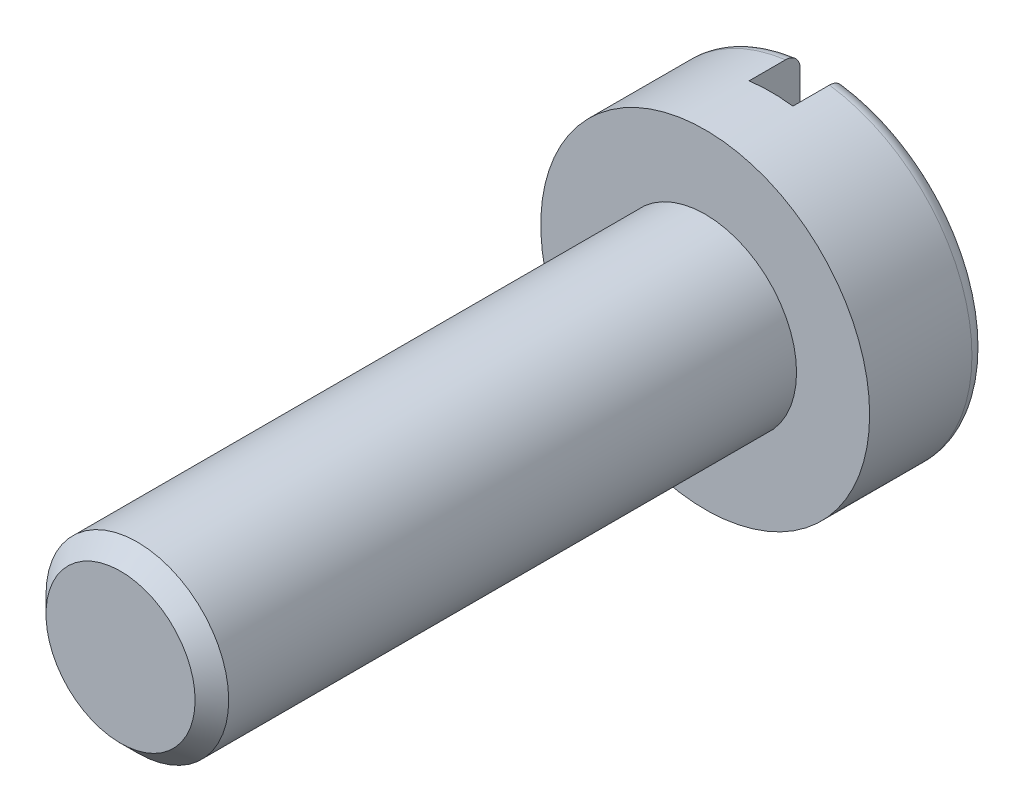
ISO-10303-21;
HEADER;
FILE_DESCRIPTION(('STEP AP214'),'2;1');
FILE_NAME('part.step','',(''),(''),'','','');
FILE_SCHEMA(('AUTOMOTIVE_DESIGN { 1 0 10303 214 1 1 1 1 }'));
ENDSEC;
DATA;
#1=APPLICATION_CONTEXT('core data for automotive mechanical design processes');
#2=APPLICATION_PROTOCOL_DEFINITION('international standard','automotive_design',2000,#1);
#3=PRODUCT_CONTEXT('',#1,'mechanical');
#4=PRODUCT('Part','Part','',(#3));
#5=PRODUCT_RELATED_PRODUCT_CATEGORY('part','',(#4));
#6=PRODUCT_DEFINITION_FORMATION('','',#4);
#7=PRODUCT_DEFINITION_CONTEXT('part definition',#1,'design');
#8=PRODUCT_DEFINITION('design','',#6,#7);
#9=PRODUCT_DEFINITION_SHAPE('','',#8);
#10=(LENGTH_UNIT() NAMED_UNIT(*) SI_UNIT(.MILLI.,.METRE.));
#11=(NAMED_UNIT(*) PLANE_ANGLE_UNIT() SI_UNIT($,.RADIAN.));
#12=(NAMED_UNIT(*) SI_UNIT($,.STERADIAN.) SOLID_ANGLE_UNIT());
#13=UNCERTAINTY_MEASURE_WITH_UNIT(LENGTH_MEASURE(1.E-05),#10,'distance_accuracy_value','');
#14=(GEOMETRIC_REPRESENTATION_CONTEXT(3) GLOBAL_UNCERTAINTY_ASSIGNED_CONTEXT((#13)) GLOBAL_UNIT_ASSIGNED_CONTEXT((#10,
#11,#12)) REPRESENTATION_CONTEXT('',''));
#15=CARTESIAN_POINT('',(0.,0.,0.));
#16=DIRECTION('',(0.,0.,1.));
#17=DIRECTION('',(1.,0.,0.));
#18=AXIS2_PLACEMENT_3D('',#15,#16,#17);
#19=CARTESIAN_POINT('',(0.,0.,-1.6));
#20=DIRECTION('',(0.,0.,1.));
#21=DIRECTION('',(1.,0.,0.));
#22=AXIS2_PLACEMENT_3D('',#19,#20,#21);
#23=PLANE('',#22);
#24=CARTESIAN_POINT('',(0.,0.,-1.6));
#25=DIRECTION('',(0.,0.,1.));
#26=DIRECTION('',(1.,0.,0.));
#27=AXIS2_PLACEMENT_3D('',#24,#25,#26);
#28=CIRCLE('',#27,2.05);
#29=CARTESIAN_POINT('',(0.3,2.02792997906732,-1.6));
#30=VERTEX_POINT('',#29);
#31=CARTESIAN_POINT('',(0.299999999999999,-2.02792997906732,-1.6));
#32=VERTEX_POINT('',#31);
#33=EDGE_CURVE('E92',#30,#32,#28,.F.);
#34=ORIENTED_EDGE('',*,*,#33,.T.);
#35=DIRECTION('',(0.,-1.,0.));
#36=VECTOR('',#35,1.);
#37=CARTESIAN_POINT('',(0.3,2.25,-1.6));
#38=LINE('',#37,#36);
#39=EDGE_CURVE('E80',#30,#32,#38,.T.);
#40=ORIENTED_EDGE('',*,*,#39,.F.);
#41=EDGE_LOOP('',(#34,#40));
#42=FACE_BOUND('',#41,.T.);
#43=ADVANCED_FACE('F26',(#42),#23,.F.);
#44=CARTESIAN_POINT('',(0.,0.,-1.4));
#45=DIRECTION('',(0.,0.,1.));
#46=DIRECTION('',(1.,0.,0.));
#47=AXIS2_PLACEMENT_3D('',#44,#45,#46);
#48=TOROIDAL_SURFACE('',#47,2.05,0.2);
#49=CARTESIAN_POINT('',(0.300000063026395,-2.1709840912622,-1.54122853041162));
#50=CARTESIAN_POINT('',(0.300000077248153,-2.17893682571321,-1.53332849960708));
#51=CARTESIAN_POINT('',(0.300000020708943,-2.18623203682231,-1.52475564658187));
#52=CARTESIAN_POINT('',(0.299999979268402,-2.19928820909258,-1.50650164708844));
#53=CARTESIAN_POINT('',(0.299999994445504,-2.20504748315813,-1.49681929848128));
#54=CARTESIAN_POINT('',(0.300000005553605,-2.2148541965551,-1.47662386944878));
#55=CARTESIAN_POINT('',(0.300000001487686,-2.21890190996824,-1.46611092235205));
#56=CARTESIAN_POINT('',(0.299999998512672,-2.22516408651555,-1.44455521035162));
#57=CARTESIAN_POINT('',(0.299999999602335,-2.22737899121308,-1.43351257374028));
#58=CARTESIAN_POINT('',(0.300000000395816,-2.22990492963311,-1.41126370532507));
#59=CARTESIAN_POINT('',(0.300000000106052,-2.2302247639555,-1.40005847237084));
#60=CARTESIAN_POINT('',(0.299999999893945,-2.22897446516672,-1.37775374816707));
#61=CARTESIAN_POINT('',(0.299999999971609,-2.22740430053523,-1.36665425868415));
#62=CARTESIAN_POINT('',(0.300000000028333,-2.22242592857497,-1.3448993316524));
#63=CARTESIAN_POINT('',(0.300000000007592,-2.2190214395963,-1.33424304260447));
#64=CARTESIAN_POINT('',(0.299999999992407,-2.21047750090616,-1.31365059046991));
#65=CARTESIAN_POINT('',(0.299999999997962,-2.20533803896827,-1.30371443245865));
#66=CARTESIAN_POINT('',(0.300000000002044,-2.19345463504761,-1.28480701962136));
#67=CARTESIAN_POINT('',(0.300000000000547,-2.18670540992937,-1.27583908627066));
#68=CARTESIAN_POINT('',(0.299999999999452,-2.17180762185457,-1.25915291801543));
#69=CARTESIAN_POINT('',(0.299999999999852,-2.16365901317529,-1.25143472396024));
#70=CARTESIAN_POINT('',(0.300000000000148,-2.146128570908,-1.23740309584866));
#71=CARTESIAN_POINT('',(0.300000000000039,-2.13673782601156,-1.23110079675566));
#72=CARTESIAN_POINT('',(0.29999999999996,-2.11703939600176,-1.2201451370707));
#73=CARTESIAN_POINT('',(0.299999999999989,-2.10673166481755,-1.21549185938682));
#74=CARTESIAN_POINT('',(0.30000000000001,-2.08538820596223,-1.20792055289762));
#75=CARTESIAN_POINT('',(0.300000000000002,-2.07434654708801,-1.2050192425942));
#76=CARTESIAN_POINT('',(0.299999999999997,-2.05193422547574,-1.2010958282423));
#77=CARTESIAN_POINT('',(0.299999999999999,-2.04056354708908,-1.20007381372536));
#78=CARTESIAN_POINT('',(0.3,-2.01772278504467,-1.19993337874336));
#79=CARTESIAN_POINT('',(0.3,-2.0062526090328,-1.20082964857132));
#80=CARTESIAN_POINT('',(0.299999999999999,-1.98362399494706,-1.20453007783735));
#81=CARTESIAN_POINT('',(0.299999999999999,-1.9724655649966,-1.20733428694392));
#82=CARTESIAN_POINT('',(0.3,-1.95075092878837,-1.21478350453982));
#83=CARTESIAN_POINT('',(0.3,-1.94019621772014,-1.21943287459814));
#84=CARTESIAN_POINT('',(0.3,-1.92002233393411,-1.23044608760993));
#85=CARTESIAN_POINT('',(0.3,-1.91040314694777,-1.23680990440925));
#86=CARTESIAN_POINT('',(0.3,-1.89242824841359,-1.25104144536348));
#87=CARTESIAN_POINT('',(0.3,-1.88406646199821,-1.25890149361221));
#88=CARTESIAN_POINT('',(0.3,-1.8687991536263,-1.27592777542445));
#89=CARTESIAN_POINT('',(0.3,-1.86189354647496,-1.28509393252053));
#90=CARTESIAN_POINT('',(0.3,-1.84981768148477,-1.30436465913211));
#91=CARTESIAN_POINT('',(0.3,-1.84462908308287,-1.31445773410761));
#92=CARTESIAN_POINT('',(0.3,-1.83604355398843,-1.33537915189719));
#93=CARTESIAN_POINT('',(0.3,-1.83264649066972,-1.3462074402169));
#94=CARTESIAN_POINT('',(0.299999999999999,-1.82778000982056,-1.36815312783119));
#95=CARTESIAN_POINT('',(0.299999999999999,-1.82628809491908,-1.37926554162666));
#96=CARTESIAN_POINT('',(0.3,-1.82520407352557,-1.40158243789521));
#97=CARTESIAN_POINT('',(0.3,-1.8256118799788,-1.41278691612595));
#98=CARTESIAN_POINT('',(0.299999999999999,-1.82830587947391,-1.43489632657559));
#99=CARTESIAN_POINT('',(0.299999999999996,-1.83058034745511,-1.44580269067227));
#100=CARTESIAN_POINT('',(0.300000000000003,-1.83692271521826,-1.46708049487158));
#101=CARTESIAN_POINT('',(0.300000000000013,-1.84099062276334,-1.4774519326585));
#102=CARTESIAN_POINT('',(0.299999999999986,-1.85081202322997,-1.49740186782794));
#103=CARTESIAN_POINT('',(0.299999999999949,-1.85657056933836,-1.50697787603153));
#104=CARTESIAN_POINT('',(0.30000000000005,-1.86959793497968,-1.52504031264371));
#105=CARTESIAN_POINT('',(0.300000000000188,-1.87686683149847,-1.53352668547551));
#106=CARTESIAN_POINT('',(0.299999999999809,-1.8927880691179,-1.54926473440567));
#107=CARTESIAN_POINT('',(0.299999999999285,-1.90145403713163,-1.55650262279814));
#108=CARTESIAN_POINT('',(0.300000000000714,-1.91986584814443,-1.56944163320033));
#109=CARTESIAN_POINT('',(0.300000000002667,-1.92961176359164,-1.57514265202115));
#110=CARTESIAN_POINT('',(0.2999999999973,-1.95003368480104,-1.58491703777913));
#111=CARTESIAN_POINT('',(0.299999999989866,-1.96071951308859,-1.58896988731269));
#112=CARTESIAN_POINT('',(0.300000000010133,-1.98261648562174,-1.59523980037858));
#113=CARTESIAN_POINT('',(0.300000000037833,-1.99382763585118,-1.59745684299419));
#114=CARTESIAN_POINT('',(0.299999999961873,-2.01655037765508,-1.60000534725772));
#115=CARTESIAN_POINT('',(0.299999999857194,-2.02806362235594,-1.60032209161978));
#116=CARTESIAN_POINT('',(0.300000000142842,-2.05098342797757,-1.59901962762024));
#117=CARTESIAN_POINT('',(0.300000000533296,-2.06238996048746,-1.59739991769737));
#118=CARTESIAN_POINT('',(0.299999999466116,-2.08477996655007,-1.59226300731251));
#119=CARTESIAN_POINT('',(0.299999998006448,-2.09576296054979,-1.58874371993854));
#120=CARTESIAN_POINT('',(0.300000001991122,-2.11696703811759,-1.57990187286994));
#121=CARTESIAN_POINT('',(0.300000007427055,-2.12718903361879,-1.57458151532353));
#122=CARTESIAN_POINT('',(0.29999999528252,-2.14303507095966,-1.56453623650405));
#123=CARTESIAN_POINT('',(0.299999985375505,-2.14897604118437,-1.56030221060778));
#124=CARTESIAN_POINT('',(0.300000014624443,-2.16036534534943,-1.5512164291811));
#125=CARTESIAN_POINT('',(0.300000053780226,-2.16581368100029,-1.54636467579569));
#126=CARTESIAN_POINT('',(0.300000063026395,-2.1709840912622,-1.54122853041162));
#127=B_SPLINE_CURVE_WITH_KNOTS('',3,(#49,#50,#51,#52,#53,#54,#55,#56,#57,#58,#59,#60,#61,#62,
#63,#64,#65,#66,#67,#68,#69,#70,#71,#72,#73,#74,#75,#76,#77,#78,#79,#80,#81,#82,#83,#84,#85,#86,
#87,#88,#89,#90,#91,#92,#93,#94,#95,#96,#97,#98,#99,#100,#101,#102,#103,#104,#105,#106,#107,
#108,#109,#110,#111,#112,#113,#114,#115,#116,#117,#118,#119,#120,#121,#122,#123,#124,#125,#126),
.UNSPECIFIED.,.T.,.F.,(4,2,2,2,2,2,2,2,2,2,2,2,2,2,2,2,2,2,2,2,2,2,2,2,2,2,2,2,2,2,2,2,2,2,2,2,
2,2,4),(0.,0.033602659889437,0.0672420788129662,0.100876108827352,0.134502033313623,
0.167971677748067,0.201441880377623,0.234844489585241,0.268247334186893,0.301761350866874,
0.335276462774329,0.369046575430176,0.402818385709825,0.436907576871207,0.470998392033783,
0.505351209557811,0.539704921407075,0.574140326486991,0.608575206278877,0.642837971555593,
0.67709873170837,0.710980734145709,0.744860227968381,0.778335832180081,0.811809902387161,
0.84507530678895,0.878340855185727,0.911706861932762,0.945074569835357,0.978789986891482,
1.01250766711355,1.0466331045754,1.08075893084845,1.11514871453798,1.14954740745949,
1.183983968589,1.21837857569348,1.24022516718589,1.26207168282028),.UNSPECIFIED.);
#128=CARTESIAN_POINT('',(0.299999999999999,-2.22991031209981,-1.40000000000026));
#129=VERTEX_POINT('',#128);
#130=EDGE_CURVE('E49',#32,#129,#127,.T.);
#131=ORIENTED_EDGE('',*,*,#130,.F.);
#132=ORIENTED_EDGE('',*,*,#33,.F.);
#133=CARTESIAN_POINT('',(0.3,1.82891649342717,-1.43649504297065));
#134=CARTESIAN_POINT('',(0.3,1.82686542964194,-1.4255865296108));
#135=CARTESIAN_POINT('',(0.3,1.82573407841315,-1.4144970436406));
#136=CARTESIAN_POINT('',(0.3,1.82535130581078,-1.3922769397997));
#137=CARTESIAN_POINT('',(0.3,1.82610203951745,-1.38114628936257));
#138=CARTESIAN_POINT('',(0.3,1.82946219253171,-1.35917492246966));
#139=CARTESIAN_POINT('',(0.3,1.8320705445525,-1.34833404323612));
#140=CARTESIAN_POINT('',(0.3,1.83906432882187,-1.32724495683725));
#141=CARTESIAN_POINT('',(0.3,1.84344937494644,-1.31699662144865));
#142=CARTESIAN_POINT('',(0.3,1.8538808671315,-1.29734280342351));
#143=CARTESIAN_POINT('',(0.3,1.85993247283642,-1.28794006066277));
#144=CARTESIAN_POINT('',(0.3,1.87351267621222,-1.27026956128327));
#145=CARTESIAN_POINT('',(0.3,1.88104139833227,-1.26200190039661));
#146=CARTESIAN_POINT('',(0.3,1.89744800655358,-1.24673992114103));
#147=CARTESIAN_POINT('',(0.3,1.90633961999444,-1.23976036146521));
#148=CARTESIAN_POINT('',(0.3,1.92515691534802,-1.22737212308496));
#149=CARTESIAN_POINT('',(0.3,1.93508266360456,-1.22196354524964));
#150=CARTESIAN_POINT('',(0.3,1.95581376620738,-1.21280503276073));
#151=CARTESIAN_POINT('',(0.3,1.96662818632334,-1.20907561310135));
#152=CARTESIAN_POINT('',(0.3,1.98872728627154,-1.20347045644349));
#153=CARTESIAN_POINT('',(0.3,2.00001198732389,-1.20159480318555));
#154=CARTESIAN_POINT('',(0.3,2.0228189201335,-1.19974163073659));
#155=CARTESIAN_POINT('',(0.3,2.03434228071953,-1.19977796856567));
#156=CARTESIAN_POINT('',(0.3,2.05721963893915,-1.20178454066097));
#157=CARTESIAN_POINT('',(0.3,2.06857363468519,-1.20375479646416));
#158=CARTESIAN_POINT('',(0.3,2.09078782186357,-1.20957833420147));
#159=CARTESIAN_POINT('',(0.3,2.10164803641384,-1.21343152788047));
#160=CARTESIAN_POINT('',(0.3,2.12256133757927,-1.2229179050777));
#161=CARTESIAN_POINT('',(0.3,2.13261444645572,-1.22855103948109));
#162=CARTESIAN_POINT('',(0.3,2.15155823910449,-1.24140147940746));
#163=CARTESIAN_POINT('',(0.3,2.16045589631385,-1.24860850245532));
#164=CARTESIAN_POINT('',(0.3,2.17690064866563,-1.26442685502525));
#165=CARTESIAN_POINT('',(0.3,2.18444781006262,-1.27303811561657));
#166=CARTESIAN_POINT('',(0.3,2.19790223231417,-1.29133439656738));
#167=CARTESIAN_POINT('',(0.3,2.20382413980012,-1.30100864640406));
#168=CARTESIAN_POINT('',(0.3,2.21394351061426,-1.32122056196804));
#169=CARTESIAN_POINT('',(0.3,2.21814106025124,-1.33175818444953));
#170=CARTESIAN_POINT('',(0.3,2.22465708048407,-1.35330117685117));
#171=CARTESIAN_POINT('',(0.3,2.22699122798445,-1.36430180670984));
#172=CARTESIAN_POINT('',(0.3,2.22976979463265,-1.38653909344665));
#173=CARTESIAN_POINT('',(0.3,2.23021427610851,-1.39777574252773));
#174=CARTESIAN_POINT('',(0.3,2.22920268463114,-1.42010972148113));
#175=CARTESIAN_POINT('',(0.3,2.22775557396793,-1.43120745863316));
#176=CARTESIAN_POINT('',(0.3,2.22301952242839,-1.45300249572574));
#177=CARTESIAN_POINT('',(0.3,2.21973059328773,-1.46369979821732));
#178=CARTESIAN_POINT('',(0.3,2.21140609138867,-1.48439782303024));
#179=CARTESIAN_POINT('',(0.3,2.20636961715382,-1.49439818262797));
#180=CARTESIAN_POINT('',(0.3,2.19469807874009,-1.51341762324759));
#181=CARTESIAN_POINT('',(0.3,2.18806297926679,-1.52243668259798));
#182=CARTESIAN_POINT('',(0.3,2.17334518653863,-1.53929284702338));
#183=CARTESIAN_POINT('',(0.3,2.16525465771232,-1.5471231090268));
#184=CARTESIAN_POINT('',(0.3,2.14788391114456,-1.56132851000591));
#185=CARTESIAN_POINT('',(0.3,2.13860364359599,-1.5677035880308));
#186=CARTESIAN_POINT('',(0.3,2.11902962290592,-1.57887821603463));
#187=CARTESIAN_POINT('',(0.3,2.10872764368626,-1.58366335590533));
#188=CARTESIAN_POINT('',(0.3,2.08747142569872,-1.59145383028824));
#189=CARTESIAN_POINT('',(0.3,2.07651715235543,-1.5944590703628));
#190=CARTESIAN_POINT('',(0.3,2.05416098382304,-1.59863125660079));
#191=CARTESIAN_POINT('',(0.3,2.04275593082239,-1.59978128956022));
#192=CARTESIAN_POINT('',(0.3,2.01991367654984,-1.60016198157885));
#193=CARTESIAN_POINT('',(0.3,2.00847647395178,-1.59939256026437));
#194=CARTESIAN_POINT('',(0.3,1.98582688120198,-1.59594673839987));
#195=CARTESIAN_POINT('',(0.3,1.97461611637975,-1.59325964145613));
#196=CARTESIAN_POINT('',(0.3,1.95280557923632,-1.58603996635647));
#197=CARTESIAN_POINT('',(0.3,1.94220578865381,-1.58150744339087));
#198=CARTESIAN_POINT('',(0.3,1.92193285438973,-1.57072584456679));
#199=CARTESIAN_POINT('',(0.3,1.91225871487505,-1.56447864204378));
#200=CARTESIAN_POINT('',(0.3,1.8941051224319,-1.55043427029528));
#201=CARTESIAN_POINT('',(0.3,1.88562592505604,-1.54263677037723));
#202=CARTESIAN_POINT('',(0.3,1.87018038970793,-1.52577773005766));
#203=CARTESIAN_POINT('',(0.3,1.86320281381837,-1.51672647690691));
#204=CARTESIAN_POINT('',(0.3,1.85089614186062,-1.49757582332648));
#205=CARTESIAN_POINT('',(0.3,1.84556492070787,-1.48747779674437));
#206=CARTESIAN_POINT('',(0.3,1.83838588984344,-1.47049633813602));
#207=CARTESIAN_POINT('',(0.3,1.83598324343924,-1.46384181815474));
#208=CARTESIAN_POINT('',(0.3,1.83190158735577,-1.45031433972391));
#209=CARTESIAN_POINT('',(0.3,1.83022257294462,-1.44344138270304));
#210=CARTESIAN_POINT('',(0.3,1.82891649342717,-1.43649504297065));
#211=B_SPLINE_CURVE_WITH_KNOTS('',3,(#133,#134,#135,#136,#137,#138,#139,#140,#141,#142,#143,
#144,#145,#146,#147,#148,#149,#150,#151,#152,#153,#154,#155,#156,#157,#158,#159,#160,#161,#162,
#163,#164,#165,#166,#167,#168,#169,#170,#171,#172,#173,#174,#175,#176,#177,#178,#179,#180,#181,
#182,#183,#184,#185,#186,#187,#188,#189,#190,#191,#192,#193,#194,#195,#196,#197,#198,#199,#200,
#201,#202,#203,#204,#205,#206,#207,#208,#209,#210),.UNSPECIFIED.,.T.,.F.,(4,2,2,2,2,2,2,2,2,2,2,
2,2,2,2,2,2,2,2,2,2,2,2,2,2,2,2,2,2,2,2,2,2,2,2,2,2,2,4),(0.,0.0332731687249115,
0.0665844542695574,0.0998766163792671,0.133161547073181,0.166550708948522,0.199942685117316,
0.233696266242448,0.267452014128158,0.30160966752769,0.335768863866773,0.37017566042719,
0.404582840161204,0.438988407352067,0.473393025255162,0.50757926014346,0.541763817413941,
0.575629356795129,0.609493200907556,0.643069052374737,0.676643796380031,0.710060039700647,
0.743476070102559,0.776909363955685,0.810343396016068,0.843963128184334,0.877584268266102,
0.911502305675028,0.945422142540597,0.979649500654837,1.01387829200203,1.04829951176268,
1.08271970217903,1.11710243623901,1.15149251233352,1.18561550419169,1.21969426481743,
1.24088214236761,1.26206988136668),.UNSPECIFIED.);
#212=CARTESIAN_POINT('',(0.3,2.22991031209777,-1.4));
#213=VERTEX_POINT('',#212);
#214=EDGE_CURVE('E77',#213,#30,#211,.T.);
#215=ORIENTED_EDGE('',*,*,#214,.F.);
#216=CARTESIAN_POINT('',(0.,0.,-1.4));
#217=DIRECTION('',(0.,0.,1.));
#218=DIRECTION('',(1.,0.,0.));
#219=AXIS2_PLACEMENT_3D('',#216,#217,#218);
#220=CIRCLE('',#219,2.25);
#221=EDGE_CURVE('E101',#129,#213,#220,.T.);
#222=ORIENTED_EDGE('',*,*,#221,.F.);
#223=EDGE_LOOP('',(#131,#132,#215,#222));
#224=FACE_BOUND('',#223,.T.);
#225=ADVANCED_FACE('F94',(#224),#48,.T.);
#226=CARTESIAN_POINT('',(0.,0.,0.));
#227=DIRECTION('',(0.,0.,1.));
#228=DIRECTION('',(1.,0.,0.));
#229=AXIS2_PLACEMENT_3D('',#226,#227,#228);
#230=PLANE('',#229);
#231=CARTESIAN_POINT('',(0.,0.,0.));
#232=DIRECTION('',(0.,0.,1.));
#233=DIRECTION('',(1.,0.,0.));
#234=AXIS2_PLACEMENT_3D('',#231,#232,#233);
#235=CIRCLE('',#234,2.25);
#236=CARTESIAN_POINT('',(2.25,0.,0.));
#237=VERTEX_POINT('',#236);
#238=EDGE_CURVE('E154',#237,#237,#235,.T.);
#239=ORIENTED_EDGE('',*,*,#238,.T.);
#240=EDGE_LOOP('',(#239));
#241=FACE_BOUND('',#240,.T.);
#242=CARTESIAN_POINT('',(0.,0.,0.));
#243=DIRECTION('',(0.,0.,1.));
#244=DIRECTION('',(1.,0.,0.));
#245=AXIS2_PLACEMENT_3D('',#242,#243,#244);
#246=CIRCLE('',#245,1.25);
#247=CARTESIAN_POINT('',(1.25,0.,0.));
#248=VERTEX_POINT('',#247);
#249=EDGE_CURVE('E151',#248,#248,#246,.T.);
#250=ORIENTED_EDGE('',*,*,#249,.F.);
#251=EDGE_LOOP('',(#250));
#252=FACE_BOUND('',#251,.T.);
#253=ADVANCED_FACE('F177',(#241,#252),#230,.T.);
#254=CARTESIAN_POINT('',(0.,0.,-1.6));
#255=DIRECTION('',(0.,0.,1.));
#256=DIRECTION('',(1.,0.,0.));
#257=AXIS2_PLACEMENT_3D('',#254,#255,#256);
#258=CYLINDRICAL_SURFACE('',#257,2.25);
#259=DIRECTION('',(0.,0.,1.));
#260=VECTOR('',#259,1.);
#261=CARTESIAN_POINT('',(0.299999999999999,-2.22991031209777,-1.6));
#262=LINE('',#261,#260);
#263=CARTESIAN_POINT('',(0.299999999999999,-2.22991031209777,-0.9));
#264=VERTEX_POINT('',#263);
#265=EDGE_CURVE('E141',#129,#264,#262,.T.);
#266=ORIENTED_EDGE('',*,*,#265,.F.);
#267=ORIENTED_EDGE('',*,*,#221,.T.);
#268=DIRECTION('',(0.,0.,1.));
#269=VECTOR('',#268,1.);
#270=CARTESIAN_POINT('',(0.3,2.22991031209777,-1.6));
#271=LINE('',#270,#269);
#272=CARTESIAN_POINT('',(0.3,2.22991031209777,-0.9));
#273=VERTEX_POINT('',#272);
#274=EDGE_CURVE('E83',#273,#213,#271,.F.);
#275=ORIENTED_EDGE('',*,*,#274,.F.);
#276=CARTESIAN_POINT('',(0.,0.,-0.9));
#277=DIRECTION('',(0.,0.,-1.));
#278=DIRECTION('',(-1.,0.,0.));
#279=AXIS2_PLACEMENT_3D('',#276,#277,#278);
#280=CIRCLE('',#279,2.25);
#281=CARTESIAN_POINT('',(-0.3,2.22991031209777,-0.9));
#282=VERTEX_POINT('',#281);
#283=EDGE_CURVE('E30',#273,#282,#280,.F.);
#284=ORIENTED_EDGE('',*,*,#283,.T.);
#285=DIRECTION('',(0.,0.,1.));
#286=VECTOR('',#285,1.);
#287=CARTESIAN_POINT('',(-0.3,2.22991031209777,-1.6));
#288=LINE('',#287,#286);
#289=CARTESIAN_POINT('',(-0.3,2.22991031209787,-1.39999999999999));
#290=VERTEX_POINT('',#289);
#291=EDGE_CURVE('E133',#290,#282,#288,.T.);
#292=ORIENTED_EDGE('',*,*,#291,.F.);
#293=CARTESIAN_POINT('',(-0.300000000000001,-2.22991031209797,-1.39999999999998));
#294=VERTEX_POINT('',#293);
#295=EDGE_CURVE('E96',#290,#294,#220,.T.);
#296=ORIENTED_EDGE('',*,*,#295,.T.);
#297=DIRECTION('',(0.,0.,1.));
#298=VECTOR('',#297,1.);
#299=CARTESIAN_POINT('',(-0.300000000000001,-2.22991031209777,-1.6));
#300=LINE('',#299,#298);
#301=CARTESIAN_POINT('',(-0.300000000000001,-2.22991031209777,-0.9));
#302=VERTEX_POINT('',#301);
#303=EDGE_CURVE('E147',#302,#294,#300,.F.);
#304=ORIENTED_EDGE('',*,*,#303,.F.);
#305=EDGE_CURVE('E11',#302,#264,#280,.F.);
#306=ORIENTED_EDGE('',*,*,#305,.T.);
#307=EDGE_LOOP('',(#266,#267,#275,#284,#292,#296,#304,#306));
#308=FACE_BOUND('',#307,.T.);
#309=ORIENTED_EDGE('',*,*,#238,.F.);
#310=EDGE_LOOP('',(#309));
#311=FACE_BOUND('',#310,.T.);
#312=ADVANCED_FACE('F28',(#308,#311),#258,.T.);
#313=CARTESIAN_POINT('',(-0.300000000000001,-2.02792997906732,-1.6));
#314=VERTEX_POINT('',#313);
#315=CARTESIAN_POINT('',(-0.3,2.02792997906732,-1.6));
#316=VERTEX_POINT('',#315);
#317=EDGE_CURVE('E95',#314,#316,#28,.F.);
#318=ORIENTED_EDGE('',*,*,#317,.T.);
#319=DIRECTION('',(0.,1.,0.));
#320=VECTOR('',#319,1.);
#321=CARTESIAN_POINT('',(-0.3,2.25,-1.6));
#322=LINE('',#321,#320);
#323=EDGE_CURVE('E41',#314,#316,#322,.T.);
#324=ORIENTED_EDGE('',*,*,#323,.F.);
#325=EDGE_LOOP('',(#318,#324));
#326=FACE_BOUND('',#325,.T.);
#327=ADVANCED_FACE('F168',(#326),#23,.F.);
#328=CARTESIAN_POINT('',(0.,0.,8.));
#329=DIRECTION('',(0.,0.,-1.));
#330=DIRECTION('',(-1.,0.,0.));
#331=AXIS2_PLACEMENT_3D('',#328,#329,#330);
#332=CYLINDRICAL_SURFACE('',#331,1.25);
#333=CARTESIAN_POINT('',(0.,0.,7.77));
#334=DIRECTION('',(0.,0.,1.));
#335=DIRECTION('',(1.,0.,0.));
#336=AXIS2_PLACEMENT_3D('',#333,#334,#335);
#337=CIRCLE('',#336,1.25);
#338=CARTESIAN_POINT('',(1.25,0.,7.77));
#339=VERTEX_POINT('',#338);
#340=EDGE_CURVE('E159',#339,#339,#337,.F.);
#341=ORIENTED_EDGE('',*,*,#340,.T.);
#342=EDGE_LOOP('',(#341));
#343=FACE_BOUND('',#342,.T.);
#344=ORIENTED_EDGE('',*,*,#249,.T.);
#345=EDGE_LOOP('',(#344));
#346=FACE_BOUND('',#345,.T.);
#347=ADVANCED_FACE('F170',(#343,#346),#332,.T.);
#348=CARTESIAN_POINT('',(0.,0.,8.));
#349=DIRECTION('',(0.,0.,1.));
#350=DIRECTION('',(1.,0.,0.));
#351=AXIS2_PLACEMENT_3D('',#348,#349,#350);
#352=PLANE('',#351);
#353=CARTESIAN_POINT('',(0.,0.,8.));
#354=DIRECTION('',(0.,0.,1.));
#355=DIRECTION('',(1.,0.,0.));
#356=AXIS2_PLACEMENT_3D('',#353,#354,#355);
#357=CIRCLE('',#356,1.02);
#358=CARTESIAN_POINT('',(1.02,0.,8.));
#359=VERTEX_POINT('',#358);
#360=EDGE_CURVE('E157',#359,#359,#357,.T.);
#361=ORIENTED_EDGE('',*,*,#360,.T.);
#362=EDGE_LOOP('',(#361));
#363=FACE_BOUND('',#362,.T.);
#364=ADVANCED_FACE('F175',(#363),#352,.T.);
#365=CARTESIAN_POINT('',(0.,0.,8.));
#366=DIRECTION('',(0.,0.,-1.));
#367=DIRECTION('',(-1.,0.,0.));
#368=AXIS2_PLACEMENT_3D('',#365,#366,#367);
#369=CONICAL_SURFACE('',#368,1.02,0.785398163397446);
#370=ORIENTED_EDGE('',*,*,#340,.F.);
#371=EDGE_LOOP('',(#370));
#372=FACE_BOUND('',#371,.T.);
#373=ORIENTED_EDGE('',*,*,#360,.F.);
#374=EDGE_LOOP('',(#373));
#375=FACE_BOUND('',#374,.T.);
#376=ADVANCED_FACE('F188',(#372,#375),#369,.T.);
#377=CARTESIAN_POINT('',(-0.300000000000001,-2.17098405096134,-1.54122848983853));
#378=CARTESIAN_POINT('',(-0.300000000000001,-2.16292293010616,-1.54923478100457));
#379=CARTESIAN_POINT('',(-0.300000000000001,-2.15417455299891,-1.55656158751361));
#380=CARTESIAN_POINT('',(-0.300000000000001,-2.13556193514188,-1.56964477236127));
#381=CARTESIAN_POINT('',(-0.300000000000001,-2.12569623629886,-1.57539906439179));
#382=CARTESIAN_POINT('',(-0.300000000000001,-2.10514841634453,-1.58516928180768));
#383=CARTESIAN_POINT('',(-0.300000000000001,-2.09446700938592,-1.58918670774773));
#384=CARTESIAN_POINT('',(-0.300000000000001,-2.07258722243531,-1.59538279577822));
#385=CARTESIAN_POINT('',(-0.3,-2.06138897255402,-1.59756191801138));
#386=CARTESIAN_POINT('',(-0.3,-2.0387133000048,-1.60003599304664));
#387=CARTESIAN_POINT('',(-0.3,-2.0272345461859,-1.60031875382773));
#388=CARTESIAN_POINT('',(-0.3,-2.00439047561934,-1.59896225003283));
#389=CARTESIAN_POINT('',(-0.3,-1.99302516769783,-1.5973228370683));
#390=CARTESIAN_POINT('',(-0.3,-1.97068009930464,-1.59215569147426));
#391=CARTESIAN_POINT('',(-0.3,-1.95970221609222,-1.58861983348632));
#392=CARTESIAN_POINT('',(-0.3,-1.93849795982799,-1.57975058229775));
#393=CARTESIAN_POINT('',(-0.3,-1.92827158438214,-1.57441719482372));
#394=CARTESIAN_POINT('',(-0.3,-1.90889335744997,-1.56211481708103));
#395=CARTESIAN_POINT('',(-0.3,-1.89973868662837,-1.55515026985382));
#396=CARTESIAN_POINT('',(-0.3,-1.88274267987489,-1.53976947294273));
#397=CARTESIAN_POINT('',(-0.3,-1.8749012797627,-1.53135329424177));
#398=CARTESIAN_POINT('',(-0.3,-1.86083733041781,-1.51339266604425));
#399=CARTESIAN_POINT('',(-0.3,-1.85459997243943,-1.50385981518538));
#400=CARTESIAN_POINT('',(-0.3,-1.84383764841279,-1.48387195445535));
#401=CARTESIAN_POINT('',(-0.3,-1.83931255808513,-1.47341701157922));
#402=CARTESIAN_POINT('',(-0.3,-1.83216100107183,-1.45202073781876));
#403=CARTESIAN_POINT('',(-0.3,-1.82951173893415,-1.44108702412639));
#404=CARTESIAN_POINT('',(-0.3,-1.82610420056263,-1.41892895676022));
#405=CARTESIAN_POINT('',(-0.3,-1.82534581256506,-1.40770462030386));
#406=CARTESIAN_POINT('',(-0.3,-1.82574190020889,-1.38538644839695));
#407=CARTESIAN_POINT('',(-0.3,-1.82688003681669,-1.37429231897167));
#408=CARTESIAN_POINT('',(-0.3,-1.83100281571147,-1.35245294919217));
#409=CARTESIAN_POINT('',(-0.3,-1.83398743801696,-1.34170770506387));
#410=CARTESIAN_POINT('',(-0.3,-1.84171241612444,-1.32086698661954));
#411=CARTESIAN_POINT('',(-0.3,-1.84645300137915,-1.31077159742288));
#412=CARTESIAN_POINT('',(-0.3,-1.85754775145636,-1.29151062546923));
#413=CARTESIAN_POINT('',(-0.3,-1.86390197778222,-1.28234507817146));
#414=CARTESIAN_POINT('',(-0.3,-1.87809975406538,-1.26511702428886));
#415=CARTESIAN_POINT('',(-0.3,-1.88595571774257,-1.25706475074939));
#416=CARTESIAN_POINT('',(-0.3,-1.90289349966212,-1.24237378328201));
#417=CARTESIAN_POINT('',(-0.3,-1.91197539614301,-1.23573517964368));
#418=CARTESIAN_POINT('',(-0.3,-1.93122681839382,-1.22397441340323));
#419=CARTESIAN_POINT('',(-0.3,-1.94140831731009,-1.21887184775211));
#420=CARTESIAN_POINT('',(-0.3,-1.96247773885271,-1.21042965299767));
#421=CARTESIAN_POINT('',(-0.3,-1.97336570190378,-1.20709012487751));
#422=CARTESIAN_POINT('',(-0.3,-1.99565170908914,-1.20223949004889));
#423=CARTESIAN_POINT('',(-0.3,-2.00705365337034,-1.2007462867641));
#424=CARTESIAN_POINT('',(-0.3,-2.02994684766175,-1.19968898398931));
#425=CARTESIAN_POINT('',(-0.3,-2.04143810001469,-1.20012493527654));
#426=CARTESIAN_POINT('',(-0.3,-2.0642185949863,-1.20292070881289));
#427=CARTESIAN_POINT('',(-0.300000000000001,-2.07550715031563,-1.20528614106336));
#428=CARTESIAN_POINT('',(-0.300000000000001,-2.09752410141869,-1.21188645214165));
#429=CARTESIAN_POINT('',(-0.300000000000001,-2.10825250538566,-1.21612130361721));
#430=CARTESIAN_POINT('',(-0.300000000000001,-2.12879503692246,-1.22632497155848));
#431=CARTESIAN_POINT('',(-0.300000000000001,-2.13861277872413,-1.23228650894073));
#432=CARTESIAN_POINT('',(-0.300000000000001,-2.15709663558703,-1.24578674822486));
#433=CARTESIAN_POINT('',(-0.300000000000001,-2.16576279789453,-1.25332538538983));
#434=CARTESIAN_POINT('',(-0.300000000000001,-2.18161691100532,-1.26969699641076));
#435=CARTESIAN_POINT('',(-0.300000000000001,-2.18881695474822,-1.27851825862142));
#436=CARTESIAN_POINT('',(-0.300000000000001,-2.20161737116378,-1.29725385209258));
#437=CARTESIAN_POINT('',(-0.300000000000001,-2.20721782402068,-1.30716812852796));
#438=CARTESIAN_POINT('',(-0.300000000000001,-2.21660648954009,-1.32770961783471));
#439=CARTESIAN_POINT('',(-0.300000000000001,-2.22041096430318,-1.33832939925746));
#440=CARTESIAN_POINT('',(-0.300000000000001,-2.22616968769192,-1.36005881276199));
#441=CARTESIAN_POINT('',(-0.300000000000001,-2.22812408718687,-1.37116840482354));
#442=CARTESIAN_POINT('',(-0.300000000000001,-2.23011755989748,-1.39348395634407));
#443=CARTESIAN_POINT('',(-0.300000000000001,-2.23016917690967,-1.40468879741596));
#444=CARTESIAN_POINT('',(-0.300000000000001,-2.22838688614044,-1.42695046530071));
#445=CARTESIAN_POINT('',(-0.300000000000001,-2.22655253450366,-1.43800725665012));
#446=CARTESIAN_POINT('',(-0.300000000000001,-2.22105646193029,-1.45964197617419));
#447=CARTESIAN_POINT('',(-0.300000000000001,-2.21739684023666,-1.47022043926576));
#448=CARTESIAN_POINT('',(-0.300000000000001,-2.20836146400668,-1.49060630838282));
#449=CARTESIAN_POINT('',(-0.300000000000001,-2.20298778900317,-1.5004146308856));
#450=CARTESIAN_POINT('',(-0.300000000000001,-2.19308139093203,-1.5153787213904));
#451=CARTESIAN_POINT('',(-0.300000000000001,-2.18903311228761,-1.52086153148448));
#452=CARTESIAN_POINT('',(-0.300000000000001,-2.18040020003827,-1.53138708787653));
#453=CARTESIAN_POINT('',(-0.300000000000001,-2.17581556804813,-1.53642983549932));
#454=CARTESIAN_POINT('',(-0.300000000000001,-2.17098405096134,-1.54122848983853));
#455=B_SPLINE_CURVE_WITH_KNOTS('',3,(#377,#378,#379,#380,#381,#382,#383,#384,#385,#386,#387,
#388,#389,#390,#391,#392,#393,#394,#395,#396,#397,#398,#399,#400,#401,#402,#403,#404,#405,#406,
#407,#408,#409,#410,#411,#412,#413,#414,#415,#416,#417,#418,#419,#420,#421,#422,#423,#424,#425,
#426,#427,#428,#429,#430,#431,#432,#433,#434,#435,#436,#437,#438,#439,#440,#441,#442,#443,#444,
#445,#446,#447,#448,#449,#450,#451,#452,#453,#454),.UNSPECIFIED.,.T.,.F.,(4,2,2,2,2,2,2,2,2,2,2,
2,2,2,2,2,2,2,2,2,2,2,2,2,2,2,2,2,2,2,2,2,2,2,2,2,2,2,4),(0.,0.0340591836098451,
0.0681633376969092,0.102237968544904,0.136304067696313,0.170588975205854,0.204876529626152,
0.239312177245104,0.273747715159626,0.308090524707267,0.342431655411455,0.376443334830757,
0.410452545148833,0.44404102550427,0.477627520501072,0.510926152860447,0.544224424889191,
0.577527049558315,0.610830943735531,0.6444230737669,0.678017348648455,0.712023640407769,
0.746031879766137,0.780367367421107,0.814703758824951,0.849140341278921,0.883576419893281,
0.91786939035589,0.952160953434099,0.986157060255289,1.02015146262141,1.05383185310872,
1.08750949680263,1.12096508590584,1.15442855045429,1.18785361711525,1.22123828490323,
1.24165207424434,1.26206580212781),.UNSPECIFIED.);
#456=EDGE_CURVE('E88',#294,#314,#455,.T.);
#457=ORIENTED_EDGE('',*,*,#456,.F.);
#458=ORIENTED_EDGE('',*,*,#295,.F.);
#459=CARTESIAN_POINT('',(-0.3,1.82891649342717,-1.43649504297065));
#460=CARTESIAN_POINT('',(-0.3,1.83098338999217,-1.44748212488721));
#461=CARTESIAN_POINT('',(-0.3,1.83398641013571,-1.45830172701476));
#462=CARTESIAN_POINT('',(-0.3,1.84177493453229,-1.47928935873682));
#463=CARTESIAN_POINT('',(-0.3,1.84656270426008,-1.48945654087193));
#464=CARTESIAN_POINT('',(-0.3,1.85776973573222,-1.50883594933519));
#465=CARTESIAN_POINT('',(-0.3,1.86418747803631,-1.51804905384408));
#466=CARTESIAN_POINT('',(-0.3,1.87846470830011,-1.5352756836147));
#467=CARTESIAN_POINT('',(-0.3,1.88632386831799,-1.54328948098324));
#468=CARTESIAN_POINT('',(-0.3,1.90333022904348,-1.55796824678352));
#469=CARTESIAN_POINT('',(-0.3,1.91248768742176,-1.56462132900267));
#470=CARTESIAN_POINT('',(-0.3,1.93177945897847,-1.57631688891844));
#471=CARTESIAN_POINT('',(-0.3,1.94191387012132,-1.58135920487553));
#472=CARTESIAN_POINT('',(-0.3,1.96299856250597,-1.58974895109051));
#473=CARTESIAN_POINT('',(-0.3,1.97395696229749,-1.59307598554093));
#474=CARTESIAN_POINT('',(-0.3,1.99627520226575,-1.59785651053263));
#475=CARTESIAN_POINT('',(-0.3,2.00763505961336,-1.59930992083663));
#476=CARTESIAN_POINT('',(-0.3,2.03051256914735,-1.60030617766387));
#477=CARTESIAN_POINT('',(-0.3,2.04203076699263,-1.59983655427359));
#478=CARTESIAN_POINT('',(-0.3,2.06482475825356,-1.59696877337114));
#479=CARTESIAN_POINT('',(-0.3,2.07610055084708,-1.59457060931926));
#480=CARTESIAN_POINT('',(-0.3,2.09807765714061,-1.58791112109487));
#481=CARTESIAN_POINT('',(-0.3,2.10877945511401,-1.58365139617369));
#482=CARTESIAN_POINT('',(-0.3,2.12930893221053,-1.5733836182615));
#483=CARTESIAN_POINT('',(-0.3,2.13913663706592,-1.56737561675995));
#484=CARTESIAN_POINT('',(-0.3,2.15756517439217,-1.55382399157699));
#485=CARTESIAN_POINT('',(-0.3,2.16617397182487,-1.54629120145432));
#486=CARTESIAN_POINT('',(-0.3,2.18198977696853,-1.52987488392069));
#487=CARTESIAN_POINT('',(-0.3,2.1891968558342,-1.52099142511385));
#488=CARTESIAN_POINT('',(-0.3,2.20193253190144,-1.50221577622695));
#489=CARTESIAN_POINT('',(-0.3,2.20747630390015,-1.49233387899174));
#490=CARTESIAN_POINT('',(-0.3,2.21681025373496,-1.47177394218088));
#491=CARTESIAN_POINT('',(-0.3,2.22060051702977,-1.46109594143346));
#492=CARTESIAN_POINT('',(-0.3,2.22628952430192,-1.43934124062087));
#493=CARTESIAN_POINT('',(-0.3,2.22820353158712,-1.42826853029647));
#494=CARTESIAN_POINT('',(-0.3,2.23013677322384,-1.40595902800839));
#495=CARTESIAN_POINT('',(-0.3,2.23015606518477,-1.39472224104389));
#496=CARTESIAN_POINT('',(-0.3,2.2283033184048,-1.37245325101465));
#497=CARTESIAN_POINT('',(-0.3,2.22643918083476,-1.36142038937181));
#498=CARTESIAN_POINT('',(-0.3,2.22088702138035,-1.33982377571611));
#499=CARTESIAN_POINT('',(-0.3,2.21719900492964,-1.32926002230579));
#500=CARTESIAN_POINT('',(-0.3,2.20810286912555,-1.30888715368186));
#501=CARTESIAN_POINT('',(-0.3,2.20269282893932,-1.29907889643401));
#502=CARTESIAN_POINT('',(-0.3,2.19031222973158,-1.28050272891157));
#503=CARTESIAN_POINT('',(-0.3,2.18334163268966,-1.27173484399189));
#504=CARTESIAN_POINT('',(-0.3,2.16799466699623,-1.25543003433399));
#505=CARTESIAN_POINT('',(-0.3,2.15961006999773,-1.24790085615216));
#506=CARTESIAN_POINT('',(-0.3,2.14170557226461,-1.23434197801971));
#507=CARTESIAN_POINT('',(-0.3,2.13218562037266,-1.2283123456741));
#508=CARTESIAN_POINT('',(-0.3,2.11218902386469,-1.21786541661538));
#509=CARTESIAN_POINT('',(-0.3,2.1017045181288,-1.21346316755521));
#510=CARTESIAN_POINT('',(-0.3,2.08014938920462,-1.20646386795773));
#511=CARTESIAN_POINT('',(-0.3,2.06907873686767,-1.20386690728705));
#512=CARTESIAN_POINT('',(-0.3,2.04656049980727,-1.20052989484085));
#513=CARTESIAN_POINT('',(-0.3,2.03511044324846,-1.19980651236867));
#514=CARTESIAN_POINT('',(-0.3,2.01225010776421,-1.20028185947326));
#515=CARTESIAN_POINT('',(-0.3,2.00083983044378,-1.20148066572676));
#516=CARTESIAN_POINT('',(-0.3,1.97832328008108,-1.20577775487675));
#517=CARTESIAN_POINT('',(-0.3,1.96721880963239,-1.20888549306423));
#518=CARTESIAN_POINT('',(-0.3,1.94569031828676,-1.21692428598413));
#519=CARTESIAN_POINT('',(-0.3,1.93526630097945,-1.22185535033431));
#520=CARTESIAN_POINT('',(-0.3,1.91541793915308,-1.23339632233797));
#521=CARTESIAN_POINT('',(-0.3,1.90599182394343,-1.24000318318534));
#522=CARTESIAN_POINT('',(-0.3,1.88839555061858,-1.25471859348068));
#523=CARTESIAN_POINT('',(-0.3,1.88022529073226,-1.26282702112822));
#524=CARTESIAN_POINT('',(-0.3,1.8654538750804,-1.28023923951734));
#525=CARTESIAN_POINT('',(-0.3,1.85883919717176,-1.28953155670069));
#526=CARTESIAN_POINT('',(-0.3,1.84728510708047,-1.30910874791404));
#527=CARTESIAN_POINT('',(-0.3,1.84234599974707,-1.31939380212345));
#528=CARTESIAN_POINT('',(-0.3,1.83434741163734,-1.3405294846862));
#529=CARTESIAN_POINT('',(-0.3,1.83126629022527,-1.35137193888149));
#530=CARTESIAN_POINT('',(-0.3,1.82699173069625,-1.37341312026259));
#531=CARTESIAN_POINT('',(-0.3,1.8257958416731,-1.38461136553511));
#532=CARTESIAN_POINT('',(-0.3,1.82541320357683,-1.40263602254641));
#533=CARTESIAN_POINT('',(-0.3,1.82562256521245,-1.40945513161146));
#534=CARTESIAN_POINT('',(-0.3,1.82674412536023,-1.42303526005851));
#535=CARTESIAN_POINT('',(-0.3,1.82765631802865,-1.42979627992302));
#536=CARTESIAN_POINT('',(-0.3,1.82891649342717,-1.43649504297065));
#537=B_SPLINE_CURVE_WITH_KNOTS('',3,(#459,#460,#461,#462,#463,#464,#465,#466,#467,#468,#469,
#470,#471,#472,#473,#474,#475,#476,#477,#478,#479,#480,#481,#482,#483,#484,#485,#486,#487,#488,
#489,#490,#491,#492,#493,#494,#495,#496,#497,#498,#499,#500,#501,#502,#503,#504,#505,#506,#507,
#508,#509,#510,#511,#512,#513,#514,#515,#516,#517,#518,#519,#520,#521,#522,#523,#524,#525,#526,
#527,#528,#529,#530,#531,#532,#533,#534,#535,#536),.UNSPECIFIED.,.T.,.F.,(4,2,2,2,2,2,2,2,2,2,2,
2,2,2,2,2,2,2,2,2,2,2,2,2,2,2,2,2,2,2,2,2,2,2,2,2,2,2,4),(0.,0.0335142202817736,
0.0670711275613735,0.100596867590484,0.134114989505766,0.167914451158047,0.201717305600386,
0.235913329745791,0.270110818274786,0.304530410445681,0.338950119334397,0.373340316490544,
0.407729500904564,0.441882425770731,0.476033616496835,0.509863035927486,0.543690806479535,
0.577241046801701,0.610790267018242,0.644199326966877,0.677608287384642,0.711054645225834,
0.744501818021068,0.77815080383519,0.811801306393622,0.845755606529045,0.879711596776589,
0.913968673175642,0.94822711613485,0.982656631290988,1.01708632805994,1.05145387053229,
1.08581862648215,1.11987260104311,1.1539327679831,1.18758815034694,1.2211997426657,
1.24163334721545,1.26206678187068),.UNSPECIFIED.);
#538=EDGE_CURVE('E99',#316,#290,#537,.T.);
#539=ORIENTED_EDGE('',*,*,#538,.F.);
#540=ORIENTED_EDGE('',*,*,#317,.F.);
#541=EDGE_LOOP('',(#457,#458,#539,#540));
#542=FACE_BOUND('',#541,.T.);
#543=ADVANCED_FACE('F112',(#542),#48,.T.);
#544=CARTESIAN_POINT('',(0.3,2.25,-0.9));
#545=DIRECTION('',(1.,0.,0.));
#546=DIRECTION('',(0.,1.,0.));
#547=AXIS2_PLACEMENT_3D('',#544,#545,#546);
#548=PLANE('',#547);
#549=ORIENTED_EDGE('',*,*,#265,.T.);
#550=DIRECTION('',(0.,-1.,0.));
#551=VECTOR('',#550,1.);
#552=CARTESIAN_POINT('',(0.3,2.25,-0.9));
#553=LINE('',#552,#551);
#554=EDGE_CURVE('E138',#273,#264,#553,.T.);
#555=ORIENTED_EDGE('',*,*,#554,.F.);
#556=ORIENTED_EDGE('',*,*,#274,.T.);
#557=ORIENTED_EDGE('',*,*,#214,.T.);
#558=ORIENTED_EDGE('',*,*,#39,.T.);
#559=ORIENTED_EDGE('',*,*,#130,.T.);
#560=EDGE_LOOP('',(#549,#555,#556,#557,#558,#559));
#561=FACE_BOUND('',#560,.T.);
#562=ADVANCED_FACE('F79',(#561),#548,.F.);
#563=CARTESIAN_POINT('',(-0.3,2.25,-0.9));
#564=DIRECTION('',(-1.,0.,0.));
#565=DIRECTION('',(0.,-1.,0.));
#566=AXIS2_PLACEMENT_3D('',#563,#564,#565);
#567=PLANE('',#566);
#568=ORIENTED_EDGE('',*,*,#303,.T.);
#569=ORIENTED_EDGE('',*,*,#456,.T.);
#570=ORIENTED_EDGE('',*,*,#323,.T.);
#571=ORIENTED_EDGE('',*,*,#538,.T.);
#572=ORIENTED_EDGE('',*,*,#291,.T.);
#573=DIRECTION('',(0.,1.,0.));
#574=VECTOR('',#573,1.);
#575=CARTESIAN_POINT('',(-0.3,2.25,-0.9));
#576=LINE('',#575,#574);
#577=EDGE_CURVE('E140',#302,#282,#576,.T.);
#578=ORIENTED_EDGE('',*,*,#577,.F.);
#579=EDGE_LOOP('',(#568,#569,#570,#571,#572,#578));
#580=FACE_BOUND('',#579,.T.);
#581=ADVANCED_FACE('F116',(#580),#567,.F.);
#582=CARTESIAN_POINT('',(0.299999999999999,-2.25,-0.9));
#583=DIRECTION('',(0.,0.,-1.));
#584=DIRECTION('',(-1.,0.,0.));
#585=AXIS2_PLACEMENT_3D('',#582,#583,#584);
#586=PLANE('',#585);
#587=ORIENTED_EDGE('',*,*,#577,.T.);
#588=ORIENTED_EDGE('',*,*,#283,.F.);
#589=ORIENTED_EDGE('',*,*,#554,.T.);
#590=ORIENTED_EDGE('',*,*,#305,.F.);
#591=EDGE_LOOP('',(#587,#588,#589,#590));
#592=FACE_BOUND('',#591,.T.);
#593=ADVANCED_FACE('F120',(#592),#586,.T.);
#594=CLOSED_SHELL('',(#43,#225,#253,#312,#327,#347,#364,#376,#543,#562,#581,#593));
#595=MANIFOLD_SOLID_BREP('B2',#594);
#596=ADVANCED_BREP_SHAPE_REPRESENTATION('',(#18,#595),#14);
#597=SHAPE_DEFINITION_REPRESENTATION(#9,#596);
ENDSEC;
END-ISO-10303-21;
